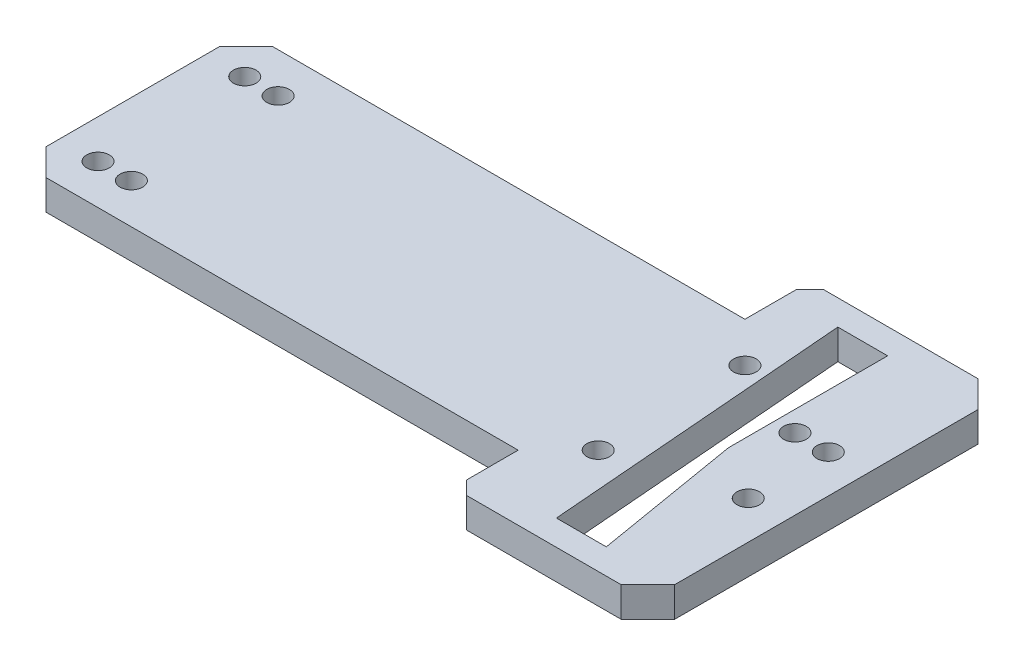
from build123d import *

# Parameters (mm, degrees)
SKETCH11_R          = 1.7
BOSS_EXTRUDE4_DEPTH = 4.5


with BuildPart() as part:
    # Sketch11 → Boss-Extrude4 (new body)
    with BuildSketch(Plane(origin=(0, 0, 0), x_dir=(1, 0, 0), z_dir=(0, 1, 0))):
        Polygon((-47, 13), (-43, 17), (27.8, 17), (27.8, 24.75), (29.8, 26.75), (53, 26.75), (57, 22.75), (57, -22.75), (53, -26.75), (29.8, -26.75), (27.8, -24.75), (27.8, -17), (-43, -17), (-47, -13), align=None)
        with Locations(Location((-41.2, 11, 0), (0, 0, 270))):
            Circle(SKETCH11_R, mode=Mode.SUBTRACT)
        with Locations(Location((-41.2, -11, 0), (0, 0, 270))):
            Circle(SKETCH11_R, mode=Mode.SUBTRACT)
        with Locations(Location((-36.2, 11, 0), (0, 0, 270))):
            Circle(SKETCH11_R, mode=Mode.SUBTRACT)
        with Locations(Location((-36.2, -11, 0), (0, 0, 270))):
            Circle(SKETCH11_R, mode=Mode.SUBTRACT)
        with Locations(Location((33.8, 11, 0), (0, 0, 270))):
            Circle(SKETCH11_R, mode=Mode.SUBTRACT)
        with Locations(Location((33.8, -11, 0), (0, 0, 270))):
            Circle(SKETCH11_R, mode=Mode.SUBTRACT)
        with Locations(Location((46.3, 6, 0), (0, 0, 270))):
            Circle(SKETCH11_R, mode=Mode.SUBTRACT)
        with Locations(Location((51.3, 6, 0), (0, 0, 270))):
            Circle(SKETCH11_R, mode=Mode.SUBTRACT)
        with Locations(Location((51.3, -6, 0), (0, 0, 270))):
            Circle(SKETCH11_R, mode=Mode.SUBTRACT)
        Polygon((43.25, -0.91213876), (46.964246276, -22.95), (39.484246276, -22.95), (35.78322444, 22.95), (43.25, 22.95), align=None, mode=Mode.SUBTRACT)
    extrude(amount=BOSS_EXTRUDE4_DEPTH)


solid = part.part
